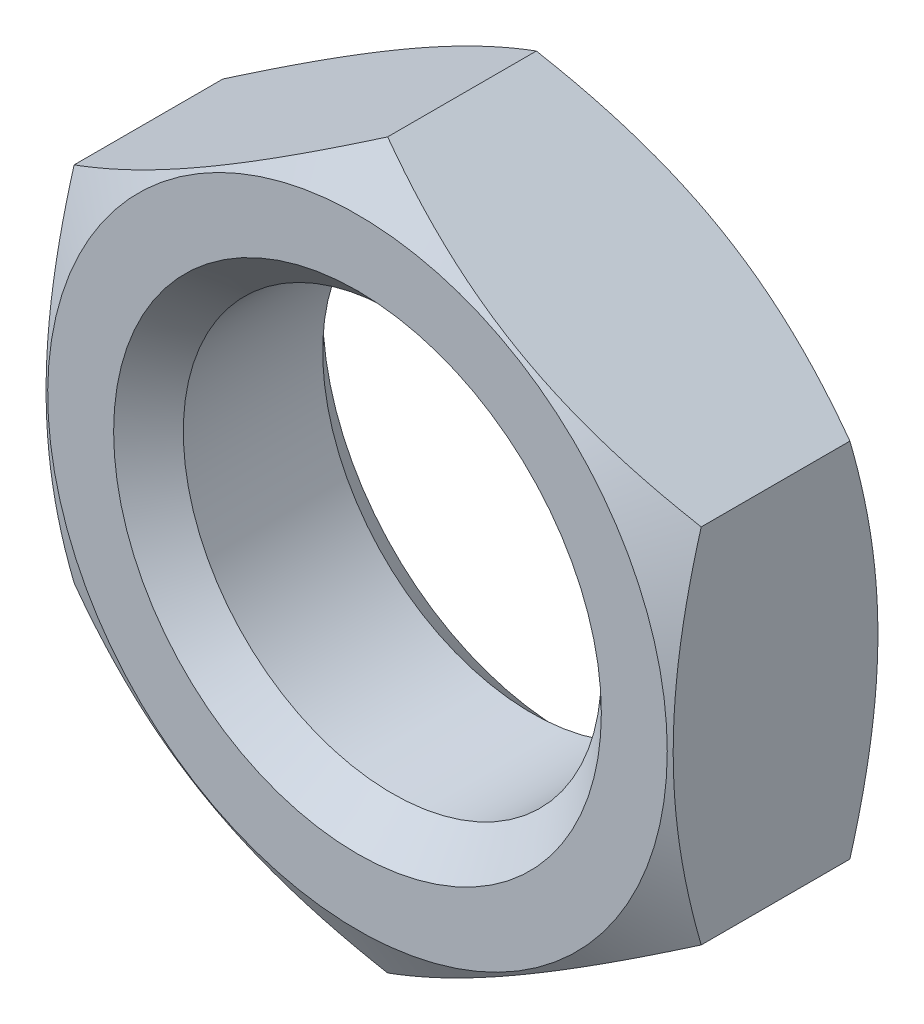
from build123d import *

# Parameters (mm, degrees)
BOSS_EXTRUDE1_DEPTH = 4.5
SKETCH6_R           = 9
CUT_EXTRUDE1_DEPTH  = 9
CHAMFER1_SIZE       = 1.5


with BuildPart() as part:
    # Sketch3 → Boss-Extrude1 (new, symmetric)
    with BuildSketch(Plane.XY):
        Polygon((0, 15.588457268), (-13.5, 7.794228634), (-13.5, -7.794228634), (0, -15.588457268), (13.5, -7.794228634), (13.5, 7.794228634), align=None)
    extrude(amount=BOSS_EXTRUDE1_DEPTH, both=True)

    # Sketch5 → Cut-Revolve1 (revolve, cut)
    with BuildSketch(Plane(origin=(0, 0, 0), x_dir=(0, 0, -1), z_dir=(1, 0, 0)), mode=Mode.PRIVATE) as cut_revolve1_sk:
        Polygon((-4.5, 15.588457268), (-4.5, 13.338457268), (-3.200961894, 15.588457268), align=None)
    cut_revolve1 = revolve(cut_revolve1_sk.sketch.rotate(Axis((0, 0, 5.457798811), (0, 0, -1)), 299.999999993), axis=Axis((0, 0, 5.457798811), (0, 0, -1)), mode=Mode.SUBTRACT)

    # Mirror1: Cut-Revolve1 across plane
    add(cut_revolve1.mirror(Plane.XY), mode=Mode.SUBTRACT)

    # Sketch6 → Cut-Extrude1 (cut)
    with BuildSketch(Plane.XY.offset(4.5)):
        Circle(SKETCH6_R)
    extrude(amount=-CUT_EXTRUDE1_DEPTH, mode=Mode.SUBTRACT)

    # Chamfer1
    chamfer1_edges = [part.edges().sort_by_distance(p)[0] for p in [
        (-9, 0, -4.5),
        (-9, 0, 4.5),
    ]]
    chamfer(chamfer1_edges, length=CHAMFER1_SIZE)


solid = part.part
